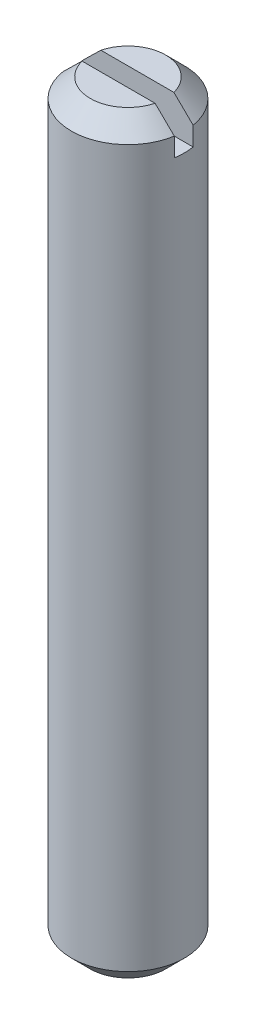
ISO-10303-21;
HEADER;
FILE_DESCRIPTION(('STEP AP214'),'2;1');
FILE_NAME('part.step','',(''),(''),'','','');
FILE_SCHEMA(('AUTOMOTIVE_DESIGN { 1 0 10303 214 1 1 1 1 }'));
ENDSEC;
DATA;
#1=APPLICATION_CONTEXT('core data for automotive mechanical design processes');
#2=APPLICATION_PROTOCOL_DEFINITION('international standard','automotive_design',2000,#1);
#3=PRODUCT_CONTEXT('',#1,'mechanical');
#4=PRODUCT('Part','Part','',(#3));
#5=PRODUCT_RELATED_PRODUCT_CATEGORY('part','',(#4));
#6=PRODUCT_DEFINITION_FORMATION('','',#4);
#7=PRODUCT_DEFINITION_CONTEXT('part definition',#1,'design');
#8=PRODUCT_DEFINITION('design','',#6,#7);
#9=PRODUCT_DEFINITION_SHAPE('','',#8);
#10=(LENGTH_UNIT() NAMED_UNIT(*) SI_UNIT(.MILLI.,.METRE.));
#11=(NAMED_UNIT(*) PLANE_ANGLE_UNIT() SI_UNIT($,.RADIAN.));
#12=(NAMED_UNIT(*) SI_UNIT($,.STERADIAN.) SOLID_ANGLE_UNIT());
#13=UNCERTAINTY_MEASURE_WITH_UNIT(LENGTH_MEASURE(1.E-05),#10,'distance_accuracy_value','');
#14=(GEOMETRIC_REPRESENTATION_CONTEXT(3) GLOBAL_UNCERTAINTY_ASSIGNED_CONTEXT((#13)) GLOBAL_UNIT_ASSIGNED_CONTEXT((#10,
#11,#12)) REPRESENTATION_CONTEXT('',''));
#15=CARTESIAN_POINT('',(0.,0.,0.));
#16=DIRECTION('',(0.,0.,1.));
#17=DIRECTION('',(1.,0.,0.));
#18=AXIS2_PLACEMENT_3D('',#15,#16,#17);
#19=CARTESIAN_POINT('',(0.,40.,0.));
#20=DIRECTION('',(0.,-1.,0.));
#21=DIRECTION('',(0.,0.,-1.));
#22=AXIS2_PLACEMENT_3D('',#19,#20,#21);
#23=CONICAL_SURFACE('',#22,2.00000000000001,0.785398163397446);
#24=CARTESIAN_POINT('',(-4.69367192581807,37.279771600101,0.5));
#25=CARTESIAN_POINT('',(-4.51443483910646,37.4579893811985,0.5));
#26=CARTESIAN_POINT('',(-4.33515077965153,37.6361600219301,0.5));
#27=CARTESIAN_POINT('',(-3.97646126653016,37.9922872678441,0.5));
#28=CARTESIAN_POINT('',(-3.79705585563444,38.170243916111,0.5));
#29=CARTESIAN_POINT('',(-3.43813042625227,38.5257900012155,0.5));
#30=CARTESIAN_POINT('',(-3.25861057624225,38.7033796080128,0.5));
#31=CARTESIAN_POINT('',(-2.98901554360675,38.9694869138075,0.5));
#32=CARTESIAN_POINT('',(-2.89908740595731,39.0581535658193,0.5));
#33=CARTESIAN_POINT('',(-2.71909881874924,39.2353574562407,0.5));
#34=CARTESIAN_POINT('',(-2.62903836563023,39.3238946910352,0.5));
#35=CARTESIAN_POINT('',(-2.44861207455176,39.5009208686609,0.5));
#36=CARTESIAN_POINT('',(-2.35824598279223,39.5894095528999,0.5));
#37=CARTESIAN_POINT('',(-2.17728099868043,39.766130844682,0.5));
#38=CARTESIAN_POINT('',(-2.08668213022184,39.8543634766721,0.5));
#39=CARTESIAN_POINT('',(-1.90520446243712,40.0304015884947,0.5));
#40=CARTESIAN_POINT('',(-1.81432592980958,40.1182073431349,0.5));
#41=CARTESIAN_POINT('',(-1.63201176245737,40.29330502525,0.5));
#42=CARTESIAN_POINT('',(-1.5405759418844,40.3805967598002,0.5));
#43=CARTESIAN_POINT('',(-1.40265369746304,40.5109681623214,0.5));
#44=CARTESIAN_POINT('',(-1.35648945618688,40.554388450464,0.5));
#45=CARTESIAN_POINT('',(-1.26387658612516,40.6409158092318,0.5));
#46=CARTESIAN_POINT('',(-1.21742798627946,40.6840229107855,0.5));
#47=CARTESIAN_POINT('',(-1.12419544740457,40.7697641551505,0.5));
#48=CARTESIAN_POINT('',(-1.07741196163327,40.8123987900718,0.5));
#49=CARTESIAN_POINT('',(-0.983285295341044,40.8970831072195,0.5));
#50=CARTESIAN_POINT('',(-0.935941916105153,40.9391325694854,0.5));
#51=CARTESIAN_POINT('',(-0.840270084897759,41.0225031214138,0.5));
#52=CARTESIAN_POINT('',(-0.791938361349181,41.0638204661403,0.5));
#53=CARTESIAN_POINT('',(-0.694121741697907,41.1449858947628,0.5));
#54=CARTESIAN_POINT('',(-0.644638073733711,41.1848354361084,0.5));
#55=CARTESIAN_POINT('',(-0.568843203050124,41.2428204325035,0.5));
#56=CARTESIAN_POINT('',(-0.543253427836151,41.2618941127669,0.5));
#57=CARTESIAN_POINT('',(-0.491447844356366,41.2991455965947,0.5));
#58=CARTESIAN_POINT('',(-0.465232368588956,41.3173238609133,0.5));
#59=CARTESIAN_POINT('',(-0.411878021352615,41.3525172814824,0.5));
#60=CARTESIAN_POINT('',(-0.384736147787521,41.3695279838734,0.5));
#61=CARTESIAN_POINT('',(-0.329320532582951,41.4017014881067,0.5));
#62=CARTESIAN_POINT('',(-0.301044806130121,41.4168608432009,0.5));
#63=CARTESIAN_POINT('',(-0.272101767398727,41.4307554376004,0.5));
#64=B_SPLINE_CURVE_WITH_KNOTS('',3,(#24,#25,#26,#27,#28,#29,#30,#31,#32,#33,#34,#35,#36,#37,#38,
#39,#40,#41,#42,#43,#44,#45,#46,#47,#48,#49,#50,#51,#52,#53,#54,#55,#56,#57,#58,#59,#60,#61,#62,
#63),.UNSPECIFIED.,.F.,.F.,(4,2,2,2,2,2,2,2,2,2,2,2,2,2,2,2,2,2,2,4),(0.,0.758279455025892,
1.51636498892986,2.27391915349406,2.65278526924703,3.03166177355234,3.41109064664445,
3.79048201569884,4.16958357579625,4.54881935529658,4.73894498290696,4.92905157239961,
5.11893688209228,5.30889173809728,5.49963455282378,5.69018256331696,5.7859167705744,
5.88160118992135,5.97763237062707,6.07383969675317),.UNSPECIFIED.);
#65=CARTESIAN_POINT('',(-2.95803989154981,39.,0.5));
#66=VERTEX_POINT('',#65);
#67=CARTESIAN_POINT('',(-1.93649167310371,40.,0.5));
#68=VERTEX_POINT('',#67);
#69=EDGE_CURVE('E170',#66,#68,#64,.T.);
#70=ORIENTED_EDGE('',*,*,#69,.F.);
#71=CARTESIAN_POINT('',(0.,39.,0.));
#72=DIRECTION('',(0.,1.,0.));
#73=DIRECTION('',(0.,0.,1.));
#74=AXIS2_PLACEMENT_3D('',#71,#72,#73);
#75=CIRCLE('',#74,3.);
#76=CARTESIAN_POINT('',(2.95803989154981,39.,0.5));
#77=VERTEX_POINT('',#76);
#78=EDGE_CURVE('E105',#66,#77,#75,.T.);
#79=ORIENTED_EDGE('',*,*,#78,.T.);
#80=CARTESIAN_POINT('',(0.718746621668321,41.1244449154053,0.5));
#81=CARTESIAN_POINT('',(0.75183002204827,41.097266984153,0.5));
#82=CARTESIAN_POINT('',(0.784630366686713,41.0697500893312,0.5));
#83=CARTESIAN_POINT('',(0.849776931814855,41.014189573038,0.5));
#84=CARTESIAN_POINT('',(0.88212319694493,40.9861460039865,0.5));
#85=CARTESIAN_POINT('',(0.946472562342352,40.9296845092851,0.5));
#86=CARTESIAN_POINT('',(0.97847574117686,40.9012666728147,0.5));
#87=CARTESIAN_POINT('',(1.04221925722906,40.8441361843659,0.5));
#88=CARTESIAN_POINT('',(1.07395958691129,40.8154235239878,0.5));
#89=CARTESIAN_POINT('',(1.16884762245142,40.7289686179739,0.5));
#90=CARTESIAN_POINT('',(1.23168669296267,40.6708879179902,0.5));
#91=CARTESIAN_POINT('',(1.35683113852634,40.5541481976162,0.5));
#92=CARTESIAN_POINT('',(1.41913647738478,40.4954891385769,0.5));
#93=CARTESIAN_POINT('',(1.53775313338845,40.3831020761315,0.5));
#94=CARTESIAN_POINT('',(1.59409673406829,40.3294081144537,0.5));
#95=CARTESIAN_POINT('',(1.70655312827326,40.2217820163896,0.5));
#96=CARTESIAN_POINT('',(1.76266592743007,40.1678498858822,0.5));
#97=CARTESIAN_POINT('',(1.93076593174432,40.0057665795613,0.5));
#98=CARTESIAN_POINT('',(2.04249473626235,39.8973475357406,0.5));
#99=CARTESIAN_POINT('',(2.30870575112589,39.6380302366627,0.5));
#100=CARTESIAN_POINT('',(2.46299543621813,39.4869346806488,0.5));
#101=CARTESIAN_POINT('',(2.77111910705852,39.1842798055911,0.5));
#102=CARTESIAN_POINT('',(2.92495309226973,39.0327204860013,0.5));
#103=CARTESIAN_POINT('',(3.23225629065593,38.7293930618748,0.5));
#104=CARTESIAN_POINT('',(3.38572565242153,38.5776251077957,0.5));
#105=CARTESIAN_POINT('',(3.6924669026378,38.2738918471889,0.5));
#106=CARTESIAN_POINT('',(3.84573879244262,38.121926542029,0.5));
#107=CARTESIAN_POINT('',(3.99895635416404,37.9699067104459,0.5));
#108=B_SPLINE_CURVE_WITH_KNOTS('',3,(#80,#81,#82,#83,#84,#85,#86,#87,#88,#89,#90,#91,#92,#93,
#94,#95,#96,#97,#98,#99,#100,#101,#102,#103,#104,#105,#106,#107),.UNSPECIFIED.,.F.,.F.,(4,2,2,2,
2,2,2,2,2,2,2,2,2,4),(0.,0.128438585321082,0.256864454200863,0.385260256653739,
0.513659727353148,0.770361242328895,1.02708002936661,1.26057164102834,1.49405752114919,
1.961112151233,2.60896585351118,3.25682031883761,3.90433629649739,4.55184780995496),.UNSPECIFIED.);
#109=CARTESIAN_POINT('',(1.93649167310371,40.,0.5));
#110=VERTEX_POINT('',#109);
#111=EDGE_CURVE('E174',#110,#77,#108,.T.);
#112=ORIENTED_EDGE('',*,*,#111,.F.);
#113=CARTESIAN_POINT('',(0.,40.,0.));
#114=DIRECTION('',(0.,1.,0.));
#115=DIRECTION('',(0.,0.,1.));
#116=AXIS2_PLACEMENT_3D('',#113,#114,#115);
#117=CIRCLE('',#116,2.00000000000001);
#118=EDGE_CURVE('E106',#68,#110,#117,.T.);
#119=ORIENTED_EDGE('',*,*,#118,.F.);
#120=EDGE_LOOP('',(#70,#79,#112,#119));
#121=FACE_BOUND('',#120,.T.);
#122=ADVANCED_FACE('F33',(#121),#23,.T.);
#123=CARTESIAN_POINT('',(-2.00000000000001,40.,0.));
#124=DIRECTION('',(0.,1.,0.));
#125=DIRECTION('',(0.,0.,1.));
#126=AXIS2_PLACEMENT_3D('',#123,#124,#125);
#127=PLANE('',#126);
#128=DIRECTION('',(1.,0.,0.));
#129=VECTOR('',#128,1.);
#130=CARTESIAN_POINT('',(-2.00000000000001,40.,0.5));
#131=LINE('',#130,#129);
#132=EDGE_CURVE('E92',#68,#110,#131,.T.);
#133=ORIENTED_EDGE('',*,*,#132,.F.);
#134=ORIENTED_EDGE('',*,*,#118,.T.);
#135=EDGE_LOOP('',(#133,#134));
#136=FACE_BOUND('',#135,.T.);
#137=ADVANCED_FACE('F159',(#136),#127,.T.);
#138=CARTESIAN_POINT('',(0.,1.,0.));
#139=DIRECTION('',(0.,1.,0.));
#140=DIRECTION('',(0.,0.,1.));
#141=AXIS2_PLACEMENT_3D('',#138,#139,#140);
#142=CONICAL_SURFACE('',#141,3.,0.785398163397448);
#143=CARTESIAN_POINT('',(0.,0.,0.));
#144=DIRECTION('',(0.,1.,0.));
#145=DIRECTION('',(0.,0.,1.));
#146=AXIS2_PLACEMENT_3D('',#143,#144,#145);
#147=CIRCLE('',#146,2.);
#148=CARTESIAN_POINT('',(0.,0.,2.));
#149=VERTEX_POINT('',#148);
#150=EDGE_CURVE('E111',#149,#149,#147,.T.);
#151=ORIENTED_EDGE('',*,*,#150,.T.);
#152=EDGE_LOOP('',(#151));
#153=FACE_BOUND('',#152,.T.);
#154=CARTESIAN_POINT('',(0.,1.,0.));
#155=DIRECTION('',(0.,1.,0.));
#156=DIRECTION('',(0.,0.,1.));
#157=AXIS2_PLACEMENT_3D('',#154,#155,#156);
#158=CIRCLE('',#157,3.);
#159=CARTESIAN_POINT('',(0.,1.,3.));
#160=VERTEX_POINT('',#159);
#161=EDGE_CURVE('E93',#160,#160,#158,.T.);
#162=ORIENTED_EDGE('',*,*,#161,.F.);
#163=EDGE_LOOP('',(#162));
#164=FACE_BOUND('',#163,.T.);
#165=ADVANCED_FACE('F35',(#153,#164),#142,.T.);
#166=CARTESIAN_POINT('',(0.,20.,0.));
#167=DIRECTION('',(0.,1.,0.));
#168=DIRECTION('',(0.,0.,1.));
#169=AXIS2_PLACEMENT_3D('',#166,#167,#168);
#170=CYLINDRICAL_SURFACE('',#169,3.);
#171=DIRECTION('',(0.,1.,0.));
#172=VECTOR('',#171,1.);
#173=CARTESIAN_POINT('',(-2.95803989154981,20.,0.5));
#174=LINE('',#173,#172);
#175=CARTESIAN_POINT('',(-2.95803989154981,38.,0.5));
#176=VERTEX_POINT('',#175);
#177=EDGE_CURVE('E56',#176,#66,#174,.T.);
#178=ORIENTED_EDGE('',*,*,#177,.F.);
#179=CARTESIAN_POINT('',(0.,38.,0.));
#180=DIRECTION('',(0.,-1.,0.));
#181=DIRECTION('',(0.,0.,-1.));
#182=AXIS2_PLACEMENT_3D('',#179,#180,#181);
#183=CIRCLE('',#182,3.);
#184=CARTESIAN_POINT('',(-2.95803989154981,38.,-0.5));
#185=VERTEX_POINT('',#184);
#186=EDGE_CURVE('E11',#185,#176,#183,.F.);
#187=ORIENTED_EDGE('',*,*,#186,.F.);
#188=DIRECTION('',(0.,1.,0.));
#189=VECTOR('',#188,1.);
#190=CARTESIAN_POINT('',(-2.95803989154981,20.,-0.5));
#191=LINE('',#190,#189);
#192=CARTESIAN_POINT('',(-2.95803989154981,39.,-0.5));
#193=VERTEX_POINT('',#192);
#194=EDGE_CURVE('E101',#193,#185,#191,.F.);
#195=ORIENTED_EDGE('',*,*,#194,.F.);
#196=CARTESIAN_POINT('',(2.95803989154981,39.,-0.5));
#197=VERTEX_POINT('',#196);
#198=EDGE_CURVE('E100',#197,#193,#75,.T.);
#199=ORIENTED_EDGE('',*,*,#198,.F.);
#200=DIRECTION('',(0.,1.,0.));
#201=VECTOR('',#200,1.);
#202=CARTESIAN_POINT('',(2.95803989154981,20.,-0.5));
#203=LINE('',#202,#201);
#204=CARTESIAN_POINT('',(2.95803989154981,38.,-0.5));
#205=VERTEX_POINT('',#204);
#206=EDGE_CURVE('E102',#205,#197,#203,.T.);
#207=ORIENTED_EDGE('',*,*,#206,.F.);
#208=CARTESIAN_POINT('',(2.95803989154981,38.,0.5));
#209=VERTEX_POINT('',#208);
#210=EDGE_CURVE('E37',#209,#205,#183,.F.);
#211=ORIENTED_EDGE('',*,*,#210,.F.);
#212=DIRECTION('',(0.,1.,0.));
#213=VECTOR('',#212,1.);
#214=CARTESIAN_POINT('',(2.95803989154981,20.,0.5));
#215=LINE('',#214,#213);
#216=EDGE_CURVE('E172',#77,#209,#215,.F.);
#217=ORIENTED_EDGE('',*,*,#216,.F.);
#218=ORIENTED_EDGE('',*,*,#78,.F.);
#219=EDGE_LOOP('',(#178,#187,#195,#199,#207,#211,#217,#218));
#220=FACE_BOUND('',#219,.T.);
#221=ORIENTED_EDGE('',*,*,#161,.T.);
#222=EDGE_LOOP('',(#221));
#223=FACE_BOUND('',#222,.T.);
#224=ADVANCED_FACE('F130',(#220,#223),#170,.T.);
#225=CARTESIAN_POINT('',(-0.272101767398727,41.4307554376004,-0.5));
#226=CARTESIAN_POINT('',(-0.294119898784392,41.4202095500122,-0.5));
#227=CARTESIAN_POINT('',(-0.315750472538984,41.4089052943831,-0.5));
#228=CARTESIAN_POINT('',(-0.35832447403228,41.3851191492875,-0.5));
#229=CARTESIAN_POINT('',(-0.379268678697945,41.372638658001,-0.5));
#230=CARTESIAN_POINT('',(-0.420541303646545,41.3468551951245,-0.5));
#231=CARTESIAN_POINT('',(-0.440871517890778,41.3335550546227,-0.5));
#232=CARTESIAN_POINT('',(-0.481091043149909,41.3062923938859,-0.5));
#233=CARTESIAN_POINT('',(-0.500980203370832,41.2923296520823,-0.5));
#234=CARTESIAN_POINT('',(-0.559951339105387,41.2497995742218,-0.5));
#235=CARTESIAN_POINT('',(-0.598495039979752,41.2204881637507,-0.5));
#236=CARTESIAN_POINT('',(-0.674640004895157,41.160600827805,-0.5));
#237=CARTESIAN_POINT('',(-0.712240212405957,41.1300235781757,-0.5));
#238=CARTESIAN_POINT('',(-0.788753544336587,41.0663741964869,-0.5));
#239=CARTESIAN_POINT('',(-0.827628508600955,41.0332563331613,-0.5));
#240=CARTESIAN_POINT('',(-0.904832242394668,40.9663886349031,-0.5));
#241=CARTESIAN_POINT('',(-0.943160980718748,40.9326387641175,-0.5));
#242=CARTESIAN_POINT('',(-1.05756614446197,40.8307132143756,-0.5));
#243=CARTESIAN_POINT('',(-1.13304884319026,40.7618723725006,-0.5));
#244=CARTESIAN_POINT('',(-1.28310282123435,40.6232110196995,-0.5));
#245=CARTESIAN_POINT('',(-1.35767409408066,40.5533905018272,-0.5));
#246=CARTESIAN_POINT('',(-1.50622712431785,40.4131411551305,-0.5));
#247=CARTESIAN_POINT('',(-1.58020894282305,40.3427123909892,-0.5));
#248=CARTESIAN_POINT('',(-1.72827330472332,40.2009810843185,-0.5));
#249=CARTESIAN_POINT('',(-1.80235326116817,40.1296758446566,-0.5));
#250=CARTESIAN_POINT('',(-1.95023793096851,39.9867767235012,-0.5));
#251=CARTESIAN_POINT('',(-2.02404263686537,39.915182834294,-0.5));
#252=CARTESIAN_POINT('',(-2.24513464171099,39.7001199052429,-0.5));
#253=CARTESIAN_POINT('',(-2.39212480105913,39.5563455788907,-0.5));
#254=CARTESIAN_POINT('',(-2.72005681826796,39.2345890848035,-0.5));
#255=CARTESIAN_POINT('',(-2.90088135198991,39.0564875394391,-0.5));
#256=CARTESIAN_POINT('',(-3.26215037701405,38.6998788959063,-0.5));
#257=CARTESIAN_POINT('',(-3.44259484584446,38.5213717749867,-0.5));
#258=CARTESIAN_POINT('',(-3.80157201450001,38.1657660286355,-0.5));
#259=CARTESIAN_POINT('',(-3.98010695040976,37.9886696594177,-0.5));
#260=CARTESIAN_POINT('',(-4.33700058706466,37.6343214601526,-0.5));
#261=CARTESIAN_POINT('',(-4.51535929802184,37.457069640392,-0.5));
#262=CARTESIAN_POINT('',(-4.69367192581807,37.279771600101,-0.5));
#263=B_SPLINE_CURVE_WITH_KNOTS('',3,(#225,#226,#227,#228,#229,#230,#231,#232,#233,#234,#235,
#236,#237,#238,#239,#240,#241,#242,#243,#244,#245,#246,#247,#248,#249,#250,#251,#252,#253,#254,
#255,#256,#257,#258,#259,#260,#261,#262),.UNSPECIFIED.,.F.,.F.,(4,2,2,2,2,2,2,2,2,2,2,2,2,2,2,2,
2,2,4),(0.,0.0731938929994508,0.146301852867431,0.219170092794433,0.292062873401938,
0.43728449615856,0.582662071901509,0.735859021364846,0.889064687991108,1.19552591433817,
1.50198931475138,1.80842051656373,2.11688431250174,2.4253564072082,3.04219663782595,
3.80361484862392,4.56507688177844,5.31949085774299,6.0738581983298),.UNSPECIFIED.);
#264=CARTESIAN_POINT('',(-1.93649167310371,40.,-0.5));
#265=VERTEX_POINT('',#264);
#266=EDGE_CURVE('E87',#265,#193,#263,.T.);
#267=ORIENTED_EDGE('',*,*,#266,.F.);
#268=CARTESIAN_POINT('',(1.93649167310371,40.,-0.5));
#269=VERTEX_POINT('',#268);
#270=EDGE_CURVE('E98',#269,#265,#117,.T.);
#271=ORIENTED_EDGE('',*,*,#270,.F.);
#272=CARTESIAN_POINT('',(3.99895635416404,37.9699067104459,-0.5));
#273=CARTESIAN_POINT('',(3.84567627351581,38.1219886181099,-0.5));
#274=CARTESIAN_POINT('',(3.69234178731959,38.2740159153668,-0.5));
#275=CARTESIAN_POINT('',(3.38548255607,38.5778656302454,-0.5));
#276=CARTESIAN_POINT('',(3.23195781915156,38.7296880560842,-0.5));
#277=CARTESIAN_POINT('',(2.92466139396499,39.033008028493,-0.5));
#278=CARTESIAN_POINT('',(2.77088977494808,39.1845056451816,-0.5));
#279=CARTESIAN_POINT('',(2.46288380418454,39.4870437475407,-0.5));
#280=CARTESIAN_POINT('',(2.30864943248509,39.6380842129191,-0.5));
#281=CARTESIAN_POINT('',(2.03697402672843,39.902725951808,-0.5));
#282=CARTESIAN_POINT('',(1.91970378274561,40.0165022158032,-0.5));
#283=CARTESIAN_POINT('',(1.74322176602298,40.1865559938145,-0.5));
#284=CARTESIAN_POINT('',(1.68430147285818,40.2431358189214,-0.5));
#285=CARTESIAN_POINT('',(1.56619583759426,40.3560212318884,-0.5));
#286=CARTESIAN_POINT('',(1.50701048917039,40.4123268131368,-0.5));
#287=CARTESIAN_POINT('',(1.38825670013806,40.5245747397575,-0.5));
#288=CARTESIAN_POINT('',(1.32868813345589,40.5805169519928,-0.5));
#289=CARTESIAN_POINT('',(1.20903497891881,40.6918396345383,-0.5));
#290=CARTESIAN_POINT('',(1.14895042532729,40.7472201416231,-0.5));
#291=CARTESIAN_POINT('',(1.02798312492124,40.8571505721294,-0.5));
#292=CARTESIAN_POINT('',(0.967100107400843,40.9117001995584,-0.5));
#293=CARTESIAN_POINT('',(0.874836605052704,40.9924687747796,-0.5));
#294=CARTESIAN_POINT('',(0.843922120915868,41.0192185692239,-0.5));
#295=CARTESIAN_POINT('',(0.781674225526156,41.0722313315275,-0.5));
#296=CARTESIAN_POINT('',(0.750340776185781,41.0984942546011,-0.5));
#297=CARTESIAN_POINT('',(0.718746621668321,41.1244449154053,-0.5));
#298=B_SPLINE_CURVE_WITH_KNOTS('',3,(#272,#273,#274,#275,#276,#277,#278,#279,#280,#281,#282,
#283,#284,#285,#286,#287,#288,#289,#290,#291,#292,#293,#294,#295,#296,#297),.UNSPECIFIED.,.F.,
.F.,(4,2,2,2,2,2,2,2,2,2,2,2,4),(0.,0.647775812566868,1.29552482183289,1.94311607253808,
2.59073565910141,3.08091268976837,3.32597509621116,3.57104338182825,3.81619689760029,
4.06133425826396,4.30655699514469,4.42919562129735,4.55184547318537),.UNSPECIFIED.);
#299=EDGE_CURVE('E48',#197,#269,#298,.T.);
#300=ORIENTED_EDGE('',*,*,#299,.F.);
#301=ORIENTED_EDGE('',*,*,#198,.T.);
#302=EDGE_LOOP('',(#267,#271,#300,#301));
#303=FACE_BOUND('',#302,.T.);
#304=ADVANCED_FACE('F97',(#303),#23,.T.);
#305=DIRECTION('',(-1.,0.,0.));
#306=VECTOR('',#305,1.);
#307=CARTESIAN_POINT('',(-2.00000000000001,40.,-0.5));
#308=LINE('',#307,#306);
#309=EDGE_CURVE('E83',#269,#265,#308,.T.);
#310=ORIENTED_EDGE('',*,*,#309,.F.);
#311=ORIENTED_EDGE('',*,*,#270,.T.);
#312=EDGE_LOOP('',(#310,#311));
#313=FACE_BOUND('',#312,.T.);
#314=ADVANCED_FACE('F104',(#313),#127,.T.);
#315=CARTESIAN_POINT('',(0.,0.,0.));
#316=DIRECTION('',(0.,-1.,0.));
#317=DIRECTION('',(0.,0.,-1.));
#318=AXIS2_PLACEMENT_3D('',#315,#316,#317);
#319=PLANE('',#318);
#320=ORIENTED_EDGE('',*,*,#150,.F.);
#321=EDGE_LOOP('',(#320));
#322=FACE_BOUND('',#321,.T.);
#323=ADVANCED_FACE('F154',(#322),#319,.T.);
#324=CARTESIAN_POINT('',(3.,38.,0.5));
#325=DIRECTION('',(0.,0.,1.));
#326=DIRECTION('',(1.,0.,0.));
#327=AXIS2_PLACEMENT_3D('',#324,#325,#326);
#328=PLANE('',#327);
#329=ORIENTED_EDGE('',*,*,#177,.T.);
#330=ORIENTED_EDGE('',*,*,#69,.T.);
#331=ORIENTED_EDGE('',*,*,#132,.T.);
#332=ORIENTED_EDGE('',*,*,#111,.T.);
#333=ORIENTED_EDGE('',*,*,#216,.T.);
#334=DIRECTION('',(1.,0.,0.));
#335=VECTOR('',#334,1.);
#336=CARTESIAN_POINT('',(3.,38.,0.5));
#337=LINE('',#336,#335);
#338=EDGE_CURVE('E124',#176,#209,#337,.T.);
#339=ORIENTED_EDGE('',*,*,#338,.F.);
#340=EDGE_LOOP('',(#329,#330,#331,#332,#333,#339));
#341=FACE_BOUND('',#340,.T.);
#342=ADVANCED_FACE('F151',(#341),#328,.F.);
#343=CARTESIAN_POINT('',(3.,38.,-0.5));
#344=DIRECTION('',(0.,0.,-1.));
#345=DIRECTION('',(-1.,0.,0.));
#346=AXIS2_PLACEMENT_3D('',#343,#344,#345);
#347=PLANE('',#346);
#348=ORIENTED_EDGE('',*,*,#194,.T.);
#349=DIRECTION('',(-1.,0.,0.));
#350=VECTOR('',#349,1.);
#351=CARTESIAN_POINT('',(3.,38.,-0.5));
#352=LINE('',#351,#350);
#353=EDGE_CURVE('E123',#205,#185,#352,.T.);
#354=ORIENTED_EDGE('',*,*,#353,.F.);
#355=ORIENTED_EDGE('',*,*,#206,.T.);
#356=ORIENTED_EDGE('',*,*,#299,.T.);
#357=ORIENTED_EDGE('',*,*,#309,.T.);
#358=ORIENTED_EDGE('',*,*,#266,.T.);
#359=EDGE_LOOP('',(#348,#354,#355,#356,#357,#358));
#360=FACE_BOUND('',#359,.T.);
#361=ADVANCED_FACE('F86',(#360),#347,.F.);
#362=CARTESIAN_POINT('',(3.,38.,0.5));
#363=DIRECTION('',(0.,-1.,0.));
#364=DIRECTION('',(0.,0.,-1.));
#365=AXIS2_PLACEMENT_3D('',#362,#363,#364);
#366=PLANE('',#365);
#367=ORIENTED_EDGE('',*,*,#353,.T.);
#368=ORIENTED_EDGE('',*,*,#186,.T.);
#369=ORIENTED_EDGE('',*,*,#338,.T.);
#370=ORIENTED_EDGE('',*,*,#210,.T.);
#371=EDGE_LOOP('',(#367,#368,#369,#370));
#372=FACE_BOUND('',#371,.T.);
#373=ADVANCED_FACE('F122',(#372),#366,.F.);
#374=CLOSED_SHELL('',(#122,#137,#165,#224,#304,#314,#323,#342,#361,#373));
#375=MANIFOLD_SOLID_BREP('B2',#374);
#376=ADVANCED_BREP_SHAPE_REPRESENTATION('',(#18,#375),#14);
#377=SHAPE_DEFINITION_REPRESENTATION(#9,#376);
ENDSEC;
END-ISO-10303-21;
